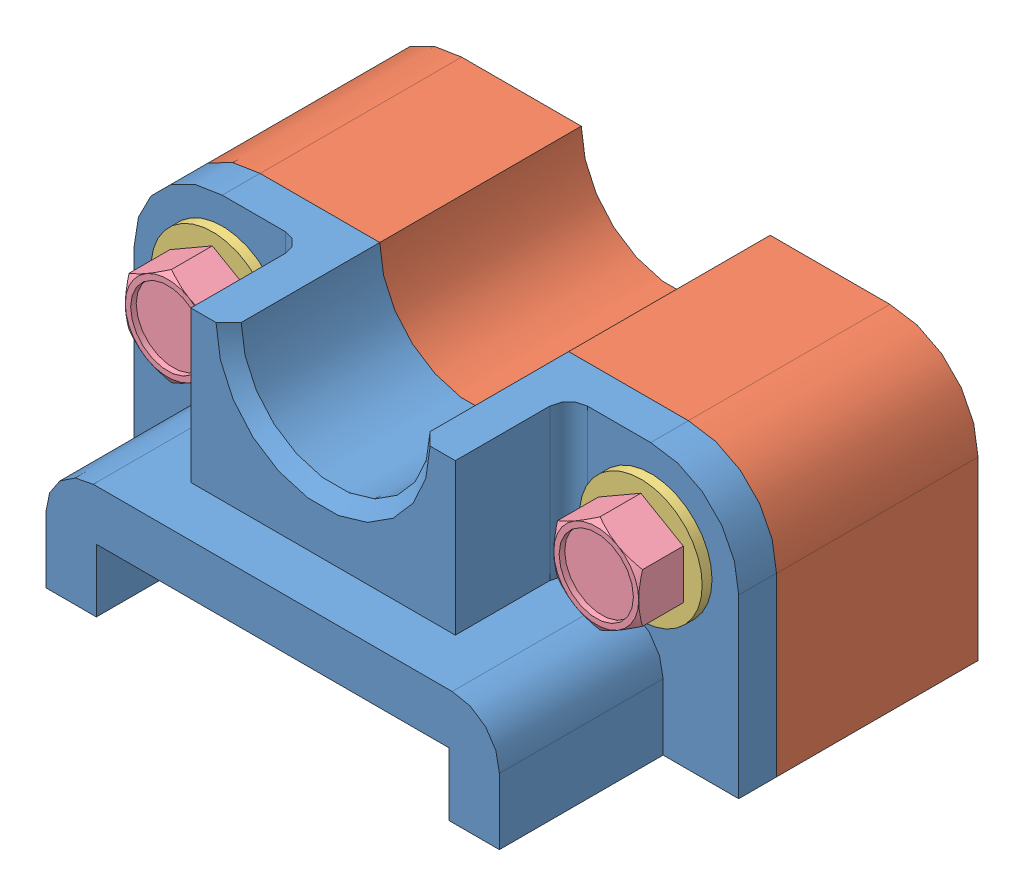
SolidWorks assembly Bearing Block Assembly.SLDASM, configuration Default (file format 8000). Lengths in mm.
Overall size (101.6 44.45 67.73).
6 component instances, 4 part files, 11 mates.
Components (placement in the parent):
- Bearing Rest-1: Bearing Rest.SLDPRT [Default] at origin size (101.6 44.45 33.87)
- Bearing Block-2: Bearing Block.SLDPRT [Default] at (101.6 0 0) size (101.6 44.45 33.87)
- flat washer type a narrow_ai-1: flat washer type a narrow_ai.sldprt [Preferred Narrow FW 0.375] at (86.8045 29.6545 6.35) x (0 0 -1) z (1 0 0) size (1.65 20.62 20.62)
- flat washer type a narrow_ai-2: flat washer type a narrow_ai.sldprt [Preferred Narrow FW 0.375] at (14.7955 29.6545 6.35) x (0 0 -1) z (1 0 0) size (1.65 20.62 20.62)
- hex screw_ai-1: hex screw_ai.sldprt [IN-HHMS 0.375-24x1x1-N] at (86.8045 29.6545 15.494) x (0 0 -1) z (1 0 0) size (32.89 16.48 14.27)
- hex screw_ai-2: hex screw_ai.sldprt [IN-HHMS 0.375-24x1x1-N] at (14.7955 29.6545 15.494) x (0 0 -1) z (1 0 0) size (32.89 16.48 14.27)
Mates (geometry in assembly coordinates):
- Coincident1: coincident anti-aligned: plane of Bearing Rest-1 through (0 0 0) normal (0 0 -1); plane of Bearing Block-2 through (86.7833 29.6333 0) normal (0 0 1)
- Coincident3: coincident aligned: plane of Bearing Block-2 through (34.925 44.45 -33.8667) normal (0 1 0); plane of Bearing Rest-1 through (101.6 44.45 6.35) normal (0 1 0)
- Concentric1: concentric aligned: cylinder of Bearing Rest-1 through (50.8 44.45 0) axis (0 0 1) radius 15.875; cylinder of Bearing Block-2 through (50.8 44.45 -33.8667) axis (0 0 1) radius 15.875
- Concentric2: concentric aligned: cylinder of Bearing Rest-1 through (86.8045 29.6545 0) axis (0 0 1) radius 5.0419; cylinder of flat washer type a narrow_ai-1 through (86.8045 29.6545 41.275) axis (0 0 1) radius 5.1562
- Coincident4: coincident anti-aligned: plane of Bearing Rest-1 through (0 0 6.35) normal (0 0 1); plane of flat washer type a narrow_ai-1 through (86.8045 34.8107 6.35) normal (0 0 -1)
- Concentric3: concentric aligned: cylinder of Bearing Rest-1 through (14.7955 29.6545 0) axis (0 0 1) radius 5.0419; cylinder of flat washer type a narrow_ai-2 through (14.7955 29.6545 41.275) axis (0 0 1) radius 5.1562
- Coincident5: coincident anti-aligned: plane of Bearing Rest-1 through (0 0 6.35) normal (0 0 1); plane of flat washer type a narrow_ai-2 through (14.7955 34.8107 6.35) normal (0 0 -1)
- Concentric4: concentric aligned: cylinder of Bearing Rest-1 through (86.8045 29.6545 0) axis (0 0 1) radius 5.0419; cylinder of hex screw_ai-1 through (86.8045 29.6545 40.894) axis (0 0 1) radius 4.7625
- Coincident6: coincident anti-aligned: plane of flat washer type a narrow_ai-1 through (86.8045 39.9669 8.001) normal (0 0 1); plane of hex screw_ai-1 through (86.8045 34.417 8.001) normal (0 0 -1)
- Concentric5: concentric aligned: cylinder of Bearing Rest-1 through (14.7955 29.6545 0) axis (0 0 1) radius 5.0419; cylinder of hex screw_ai-2 through (14.7955 29.6545 40.894) axis (0 0 1) radius 4.7625
- Coincident7: coincident anti-aligned: plane of flat washer type a narrow_ai-2 through (14.7955 39.9669 8.001) normal (0 0 1); plane of hex screw_ai-2 through (14.7955 34.417 8.001) normal (0 0 -1)
